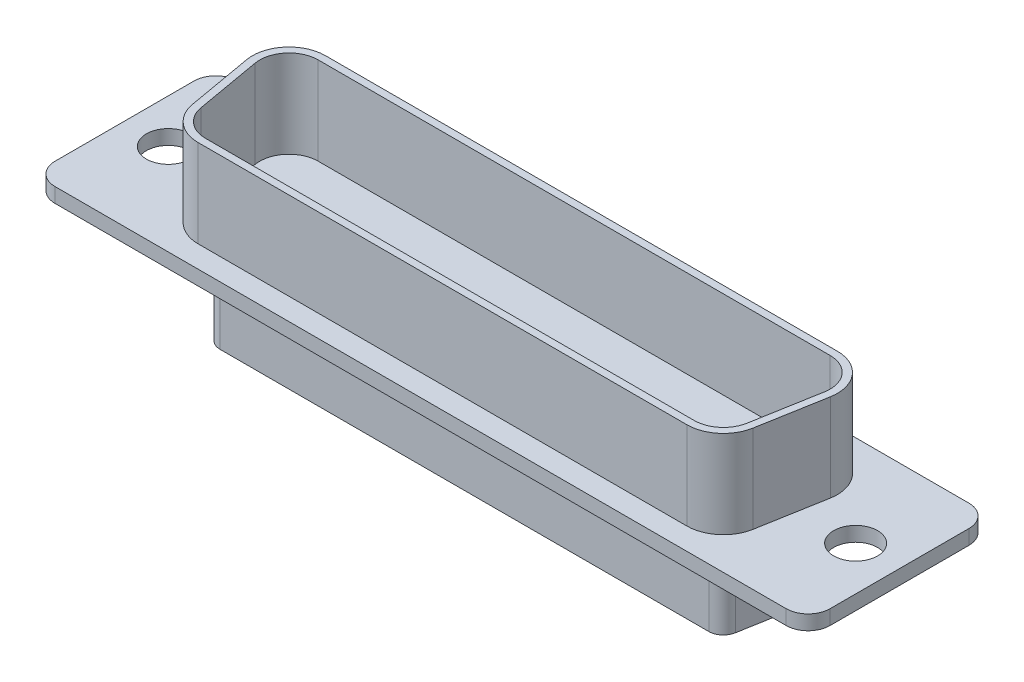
ISO-10303-21;
HEADER;
FILE_DESCRIPTION(('STEP AP214'),'2;1');
FILE_NAME('part.step','',(''),(''),'','','');
FILE_SCHEMA(('AUTOMOTIVE_DESIGN { 1 0 10303 214 1 1 1 1 }'));
ENDSEC;
DATA;
#1=APPLICATION_CONTEXT('core data for automotive mechanical design processes');
#2=APPLICATION_PROTOCOL_DEFINITION('international standard','automotive_design',2000,#1);
#3=PRODUCT_CONTEXT('',#1,'mechanical');
#4=PRODUCT('Part','Part','',(#3));
#5=PRODUCT_RELATED_PRODUCT_CATEGORY('part','',(#4));
#6=PRODUCT_DEFINITION_FORMATION('','',#4);
#7=PRODUCT_DEFINITION_CONTEXT('part definition',#1,'design');
#8=PRODUCT_DEFINITION('design','',#6,#7);
#9=PRODUCT_DEFINITION_SHAPE('','',#8);
#10=(LENGTH_UNIT() NAMED_UNIT(*) SI_UNIT(.MILLI.,.METRE.));
#11=(NAMED_UNIT(*) PLANE_ANGLE_UNIT() SI_UNIT($,.RADIAN.));
#12=(NAMED_UNIT(*) SI_UNIT($,.STERADIAN.) SOLID_ANGLE_UNIT());
#13=UNCERTAINTY_MEASURE_WITH_UNIT(LENGTH_MEASURE(1.E-05),#10,'distance_accuracy_value','');
#14=(GEOMETRIC_REPRESENTATION_CONTEXT(3) GLOBAL_UNCERTAINTY_ASSIGNED_CONTEXT((#13)) GLOBAL_UNIT_ASSIGNED_CONTEXT((#10,
#11,#12)) REPRESENTATION_CONTEXT('',''));
#15=CARTESIAN_POINT('',(0.,0.,0.));
#16=DIRECTION('',(0.,0.,1.));
#17=DIRECTION('',(1.,0.,0.));
#18=AXIS2_PLACEMENT_3D('',#15,#16,#17);
#19=CARTESIAN_POINT('',(0.,1.,0.));
#20=DIRECTION('',(0.,1.,0.));
#21=DIRECTION('',(0.,0.,1.));
#22=AXIS2_PLACEMENT_3D('',#19,#20,#21);
#23=PLANE('',#22);
#24=CARTESIAN_POINT('',(17.5,1.,-2.25));
#25=DIRECTION('',(0.,1.,0.));
#26=DIRECTION('',(0.,0.,1.));
#27=AXIS2_PLACEMENT_3D('',#24,#25,#26);
#28=CIRCLE('',#27,2.);
#29=CARTESIAN_POINT('',(19.4696155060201,1.,-1.90270364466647));
#30=VERTEX_POINT('',#29);
#31=CARTESIAN_POINT('',(17.5,1.,-4.25));
#32=VERTEX_POINT('',#31);
#33=EDGE_CURVE('E19',#30,#32,#28,.T.);
#34=ORIENTED_EDGE('',*,*,#33,.T.);
#35=DIRECTION('',(1.,0.,0.));
#36=VECTOR('',#35,1.);
#37=CARTESIAN_POINT('',(-17.5,1.,-4.25));
#38=LINE('',#37,#36);
#39=CARTESIAN_POINT('',(-17.5,1.,-4.25));
#40=VERTEX_POINT('',#39);
#41=EDGE_CURVE('E352',#40,#32,#38,.T.);
#42=ORIENTED_EDGE('',*,*,#41,.F.);
#43=CARTESIAN_POINT('',(-17.5,1.,-2.25));
#44=DIRECTION('',(0.,1.,0.));
#45=DIRECTION('',(0.,0.,1.));
#46=AXIS2_PLACEMENT_3D('',#43,#44,#45);
#47=CIRCLE('',#46,2.);
#48=CARTESIAN_POINT('',(-19.4696155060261,1.,-1.90270364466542));
#49=VERTEX_POINT('',#48);
#50=EDGE_CURVE('E353',#40,#49,#47,.T.);
#51=ORIENTED_EDGE('',*,*,#50,.T.);
#52=DIRECTION('',(-0.173648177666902,0.,-0.984807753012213));
#53=VECTOR('',#52,1.);
#54=CARTESIAN_POINT('',(-18.67614409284,1.,2.597296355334));
#55=LINE('',#54,#53);
#56=CARTESIAN_POINT('',(-18.6761440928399,1.,2.59729635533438));
#57=VERTEX_POINT('',#56);
#58=EDGE_CURVE('E357',#57,#49,#55,.T.);
#59=ORIENTED_EDGE('',*,*,#58,.F.);
#60=CARTESIAN_POINT('',(-16.70652858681,1.,2.25));
#61=DIRECTION('',(0.,1.,0.));
#62=DIRECTION('',(0.,0.,1.));
#63=AXIS2_PLACEMENT_3D('',#60,#61,#62);
#64=CIRCLE('',#63,2.);
#65=CARTESIAN_POINT('',(-16.70652858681,1.,4.25));
#66=VERTEX_POINT('',#65);
#67=EDGE_CURVE('E358',#57,#66,#64,.T.);
#68=ORIENTED_EDGE('',*,*,#67,.T.);
#69=DIRECTION('',(-1.,0.,0.));
#70=VECTOR('',#69,1.);
#71=CARTESIAN_POINT('',(16.70652858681,1.,4.25));
#72=LINE('',#71,#70);
#73=CARTESIAN_POINT('',(16.70652858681,1.,4.25));
#74=VERTEX_POINT('',#73);
#75=EDGE_CURVE('E245',#74,#66,#72,.T.);
#76=ORIENTED_EDGE('',*,*,#75,.F.);
#77=CARTESIAN_POINT('',(16.70652858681,1.,2.25));
#78=DIRECTION('',(0.,1.,0.));
#79=DIRECTION('',(0.,0.,1.));
#80=AXIS2_PLACEMENT_3D('',#77,#78,#79);
#81=CIRCLE('',#80,2.);
#82=CARTESIAN_POINT('',(18.6761440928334,1.,2.59729635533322));
#83=VERTEX_POINT('',#82);
#84=EDGE_CURVE('E241',#74,#83,#81,.T.);
#85=ORIENTED_EDGE('',*,*,#84,.T.);
#86=DIRECTION('',(-0.173648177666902,0.,0.984807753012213));
#87=VECTOR('',#86,1.);
#88=CARTESIAN_POINT('',(19.46961550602,1.,-1.902703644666));
#89=LINE('',#88,#87);
#90=EDGE_CURVE('E235',#30,#83,#89,.T.);
#91=ORIENTED_EDGE('',*,*,#90,.F.);
#92=EDGE_LOOP('',(#34,#42,#51,#59,#68,#76,#85,#91));
#93=FACE_BOUND('',#92,.T.);
#94=ADVANCED_FACE('F16',(#93),#23,.T.);
#95=CARTESIAN_POINT('',(17.5,1.,-2.25));
#96=DIRECTION('',(0.,1.,0.));
#97=DIRECTION('',(0.,0.,1.));
#98=AXIS2_PLACEMENT_3D('',#95,#96,#97);
#99=CYLINDRICAL_SURFACE('',#98,2.);
#100=CARTESIAN_POINT('',(17.5,7.,-2.25));
#101=DIRECTION('',(0.,1.,0.));
#102=DIRECTION('',(0.,0.,1.));
#103=AXIS2_PLACEMENT_3D('',#100,#101,#102);
#104=CIRCLE('',#103,2.);
#105=CARTESIAN_POINT('',(17.5,7.,-4.25));
#106=VERTEX_POINT('',#105);
#107=CARTESIAN_POINT('',(19.4696155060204,7.,-1.90270364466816));
#108=VERTEX_POINT('',#107);
#109=EDGE_CURVE('E350',#106,#108,#104,.F.);
#110=ORIENTED_EDGE('',*,*,#109,.F.);
#111=DIRECTION('',(0.,1.,0.));
#112=VECTOR('',#111,1.);
#113=CARTESIAN_POINT('',(17.5,1.,-4.25));
#114=LINE('',#113,#112);
#115=EDGE_CURVE('E227',#32,#106,#114,.T.);
#116=ORIENTED_EDGE('',*,*,#115,.F.);
#117=ORIENTED_EDGE('',*,*,#33,.F.);
#118=DIRECTION('',(0.,1.,0.));
#119=VECTOR('',#118,1.);
#120=CARTESIAN_POINT('',(19.46961550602,1.,-1.902703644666));
#121=LINE('',#120,#119);
#122=EDGE_CURVE('E225',#108,#30,#121,.F.);
#123=ORIENTED_EDGE('',*,*,#122,.F.);
#124=EDGE_LOOP('',(#110,#116,#117,#123));
#125=FACE_BOUND('',#124,.T.);
#126=ADVANCED_FACE('F224',(#125),#99,.F.);
#127=CARTESIAN_POINT('',(19.46961550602,1.,-1.902703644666));
#128=DIRECTION('',(-0.984807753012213,0.,-0.173648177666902));
#129=DIRECTION('',(-0.173648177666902,0.,0.984807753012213));
#130=AXIS2_PLACEMENT_3D('',#127,#128,#129);
#131=PLANE('',#130);
#132=ORIENTED_EDGE('',*,*,#122,.T.);
#133=ORIENTED_EDGE('',*,*,#90,.T.);
#134=DIRECTION('',(0.,1.,0.));
#135=VECTOR('',#134,1.);
#136=CARTESIAN_POINT('',(18.6761440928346,1.,2.59729635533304));
#137=LINE('',#136,#135);
#138=CARTESIAN_POINT('',(18.6761440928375,7.,2.59729635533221));
#139=VERTEX_POINT('',#138);
#140=EDGE_CURVE('E243',#83,#139,#137,.T.);
#141=ORIENTED_EDGE('',*,*,#140,.T.);
#142=DIRECTION('',(-0.173648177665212,0.,0.984807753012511));
#143=VECTOR('',#142,1.);
#144=CARTESIAN_POINT('',(19.46961550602,7.,-1.902703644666));
#145=LINE('',#144,#143);
#146=EDGE_CURVE('E237',#108,#139,#145,.T.);
#147=ORIENTED_EDGE('',*,*,#146,.F.);
#148=EDGE_LOOP('',(#132,#133,#141,#147));
#149=FACE_BOUND('',#148,.T.);
#150=ADVANCED_FACE('F233',(#149),#131,.T.);
#151=CARTESIAN_POINT('',(16.70652858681,1.,2.25));
#152=DIRECTION('',(0.,1.,0.));
#153=DIRECTION('',(0.,0.,1.));
#154=AXIS2_PLACEMENT_3D('',#151,#152,#153);
#155=CYLINDRICAL_SURFACE('',#154,2.);
#156=CARTESIAN_POINT('',(16.70652858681,7.,2.25));
#157=DIRECTION('',(0.,1.,0.));
#158=DIRECTION('',(0.,0.,1.));
#159=AXIS2_PLACEMENT_3D('',#156,#157,#158);
#160=CIRCLE('',#159,2.);
#161=CARTESIAN_POINT('',(16.70652858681,7.,4.25));
#162=VERTEX_POINT('',#161);
#163=EDGE_CURVE('E348',#139,#162,#160,.F.);
#164=ORIENTED_EDGE('',*,*,#163,.F.);
#165=ORIENTED_EDGE('',*,*,#140,.F.);
#166=ORIENTED_EDGE('',*,*,#84,.F.);
#167=DIRECTION('',(0.,1.,0.));
#168=VECTOR('',#167,1.);
#169=CARTESIAN_POINT('',(16.70652858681,1.,4.25));
#170=LINE('',#169,#168);
#171=EDGE_CURVE('E365',#162,#74,#170,.F.);
#172=ORIENTED_EDGE('',*,*,#171,.F.);
#173=EDGE_LOOP('',(#164,#165,#166,#172));
#174=FACE_BOUND('',#173,.T.);
#175=ADVANCED_FACE('F823',(#174),#155,.F.);
#176=CARTESIAN_POINT('',(16.70652858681,1.,4.25));
#177=DIRECTION('',(0.,0.,-1.));
#178=DIRECTION('',(-1.,0.,0.));
#179=AXIS2_PLACEMENT_3D('',#176,#177,#178);
#180=PLANE('',#179);
#181=ORIENTED_EDGE('',*,*,#171,.T.);
#182=ORIENTED_EDGE('',*,*,#75,.T.);
#183=DIRECTION('',(0.,1.,0.));
#184=VECTOR('',#183,1.);
#185=CARTESIAN_POINT('',(-16.70652858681,1.,4.25));
#186=LINE('',#185,#184);
#187=CARTESIAN_POINT('',(-16.70652858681,7.,4.25));
#188=VERTEX_POINT('',#187);
#189=EDGE_CURVE('E360',#66,#188,#186,.T.);
#190=ORIENTED_EDGE('',*,*,#189,.T.);
#191=DIRECTION('',(1.,0.,0.));
#192=VECTOR('',#191,1.);
#193=CARTESIAN_POINT('',(0.,7.,4.25));
#194=LINE('',#193,#192);
#195=EDGE_CURVE('E347',#162,#188,#194,.F.);
#196=ORIENTED_EDGE('',*,*,#195,.F.);
#197=EDGE_LOOP('',(#181,#182,#190,#196));
#198=FACE_BOUND('',#197,.T.);
#199=ADVANCED_FACE('F814',(#198),#180,.T.);
#200=CARTESIAN_POINT('',(-16.70652858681,1.,2.25));
#201=DIRECTION('',(0.,1.,0.));
#202=DIRECTION('',(0.,0.,1.));
#203=AXIS2_PLACEMENT_3D('',#200,#201,#202);
#204=CYLINDRICAL_SURFACE('',#203,2.);
#205=CARTESIAN_POINT('',(-16.70652858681,7.,2.25));
#206=DIRECTION('',(0.,1.,0.));
#207=DIRECTION('',(0.,0.,1.));
#208=AXIS2_PLACEMENT_3D('',#205,#206,#207);
#209=CIRCLE('',#208,2.);
#210=CARTESIAN_POINT('',(-18.6761440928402,7.,2.59729635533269));
#211=VERTEX_POINT('',#210);
#212=EDGE_CURVE('E345',#188,#211,#209,.F.);
#213=ORIENTED_EDGE('',*,*,#212,.F.);
#214=ORIENTED_EDGE('',*,*,#189,.F.);
#215=ORIENTED_EDGE('',*,*,#67,.F.);
#216=DIRECTION('',(0.,1.,0.));
#217=VECTOR('',#216,1.);
#218=CARTESIAN_POINT('',(-18.67614409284,1.,2.597296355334));
#219=LINE('',#218,#217);
#220=EDGE_CURVE('E363',#211,#57,#219,.F.);
#221=ORIENTED_EDGE('',*,*,#220,.F.);
#222=EDGE_LOOP('',(#213,#214,#215,#221));
#223=FACE_BOUND('',#222,.T.);
#224=ADVANCED_FACE('F806',(#223),#204,.F.);
#225=CARTESIAN_POINT('',(-18.67614409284,1.,2.597296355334));
#226=DIRECTION('',(0.984807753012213,0.,-0.173648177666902));
#227=DIRECTION('',(-0.173648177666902,0.,-0.984807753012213));
#228=AXIS2_PLACEMENT_3D('',#225,#226,#227);
#229=PLANE('',#228);
#230=ORIENTED_EDGE('',*,*,#220,.T.);
#231=ORIENTED_EDGE('',*,*,#58,.T.);
#232=DIRECTION('',(0.,1.,0.));
#233=VECTOR('',#232,1.);
#234=CARTESIAN_POINT('',(-19.4696155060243,1.,-1.90270364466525));
#235=LINE('',#234,#233);
#236=CARTESIAN_POINT('',(-19.4696155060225,7.,-1.90270364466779));
#237=VERTEX_POINT('',#236);
#238=EDGE_CURVE('E356',#49,#237,#235,.T.);
#239=ORIENTED_EDGE('',*,*,#238,.T.);
#240=DIRECTION('',(-0.173648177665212,0.,-0.984807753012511));
#241=VECTOR('',#240,1.);
#242=CARTESIAN_POINT('',(-18.67614409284,7.,2.597296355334));
#243=LINE('',#242,#241);
#244=EDGE_CURVE('E344',#211,#237,#243,.T.);
#245=ORIENTED_EDGE('',*,*,#244,.F.);
#246=EDGE_LOOP('',(#230,#231,#239,#245));
#247=FACE_BOUND('',#246,.T.);
#248=ADVANCED_FACE('F797',(#247),#229,.T.);
#249=CARTESIAN_POINT('',(-17.5,1.,-2.25));
#250=DIRECTION('',(0.,1.,0.));
#251=DIRECTION('',(0.,0.,1.));
#252=AXIS2_PLACEMENT_3D('',#249,#250,#251);
#253=CYLINDRICAL_SURFACE('',#252,2.);
#254=CARTESIAN_POINT('',(-17.5,7.,-2.25));
#255=DIRECTION('',(0.,1.,0.));
#256=DIRECTION('',(0.,0.,1.));
#257=AXIS2_PLACEMENT_3D('',#254,#255,#256);
#258=CIRCLE('',#257,2.);
#259=CARTESIAN_POINT('',(-17.5,7.,-4.25));
#260=VERTEX_POINT('',#259);
#261=EDGE_CURVE('E341',#237,#260,#258,.F.);
#262=ORIENTED_EDGE('',*,*,#261,.F.);
#263=ORIENTED_EDGE('',*,*,#238,.F.);
#264=ORIENTED_EDGE('',*,*,#50,.F.);
#265=DIRECTION('',(0.,1.,0.));
#266=VECTOR('',#265,1.);
#267=CARTESIAN_POINT('',(-17.5,1.,-4.25));
#268=LINE('',#267,#266);
#269=EDGE_CURVE('E375',#260,#40,#268,.F.);
#270=ORIENTED_EDGE('',*,*,#269,.F.);
#271=EDGE_LOOP('',(#262,#263,#264,#270));
#272=FACE_BOUND('',#271,.T.);
#273=ADVANCED_FACE('F788',(#272),#253,.F.);
#274=CARTESIAN_POINT('',(-17.5,1.,-4.25));
#275=DIRECTION('',(0.,0.,1.));
#276=DIRECTION('',(1.,0.,0.));
#277=AXIS2_PLACEMENT_3D('',#274,#275,#276);
#278=PLANE('',#277);
#279=ORIENTED_EDGE('',*,*,#269,.T.);
#280=ORIENTED_EDGE('',*,*,#41,.T.);
#281=ORIENTED_EDGE('',*,*,#115,.T.);
#282=DIRECTION('',(1.,0.,0.));
#283=VECTOR('',#282,1.);
#284=CARTESIAN_POINT('',(0.,7.,-4.25));
#285=LINE('',#284,#283);
#286=EDGE_CURVE('E343',#260,#106,#285,.T.);
#287=ORIENTED_EDGE('',*,*,#286,.F.);
#288=EDGE_LOOP('',(#279,#280,#281,#287));
#289=FACE_BOUND('',#288,.T.);
#290=ADVANCED_FACE('F779',(#289),#278,.T.);
#291=CARTESIAN_POINT('',(0.,7.,0.));
#292=DIRECTION('',(0.,1.,0.));
#293=DIRECTION('',(0.,0.,1.));
#294=AXIS2_PLACEMENT_3D('',#291,#292,#293);
#295=PLANE('',#294);
#296=ORIENTED_EDGE('',*,*,#261,.T.);
#297=ORIENTED_EDGE('',*,*,#286,.T.);
#298=ORIENTED_EDGE('',*,*,#109,.T.);
#299=ORIENTED_EDGE('',*,*,#146,.T.);
#300=ORIENTED_EDGE('',*,*,#163,.T.);
#301=ORIENTED_EDGE('',*,*,#195,.T.);
#302=ORIENTED_EDGE('',*,*,#212,.T.);
#303=ORIENTED_EDGE('',*,*,#244,.T.);
#304=EDGE_LOOP('',(#296,#297,#298,#299,#300,#301,#302,#303));
#305=FACE_BOUND('',#304,.T.);
#306=DIRECTION('',(-1.,0.,0.));
#307=VECTOR('',#306,1.);
#308=CARTESIAN_POINT('',(17.5,7.,-4.75));
#309=LINE('',#308,#307);
#310=CARTESIAN_POINT('',(-17.5,7.,-4.75));
#311=VERTEX_POINT('',#310);
#312=CARTESIAN_POINT('',(17.5,7.,-4.75));
#313=VERTEX_POINT('',#312);
#314=EDGE_CURVE('E398',#311,#313,#309,.F.);
#315=ORIENTED_EDGE('',*,*,#314,.F.);
#316=CARTESIAN_POINT('',(-17.5,7.,-2.25));
#317=DIRECTION('',(0.,1.,0.));
#318=DIRECTION('',(0.,0.,1.));
#319=AXIS2_PLACEMENT_3D('',#316,#317,#318);
#320=CIRCLE('',#319,2.5);
#321=CARTESIAN_POINT('',(-19.9620193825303,7.,-1.81587955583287));
#322=VERTEX_POINT('',#321);
#323=EDGE_CURVE('E325',#322,#311,#320,.F.);
#324=ORIENTED_EDGE('',*,*,#323,.F.);
#325=DIRECTION('',(0.173648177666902,0.,0.984807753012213));
#326=VECTOR('',#325,1.);
#327=CARTESIAN_POINT('',(-19.96201938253,7.,-1.815879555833));
#328=LINE('',#327,#326);
#329=CARTESIAN_POINT('',(-19.168547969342,7.,2.68412044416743));
#330=VERTEX_POINT('',#329);
#331=EDGE_CURVE('E391',#330,#322,#328,.F.);
#332=ORIENTED_EDGE('',*,*,#331,.F.);
#333=CARTESIAN_POINT('',(-16.70652858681,7.,2.25));
#334=DIRECTION('',(0.,1.,0.));
#335=DIRECTION('',(0.,0.,1.));
#336=AXIS2_PLACEMENT_3D('',#333,#334,#335);
#337=CIRCLE('',#336,2.5);
#338=CARTESIAN_POINT('',(-16.70652858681,7.,4.75));
#339=VERTEX_POINT('',#338);
#340=EDGE_CURVE('E329',#339,#330,#337,.F.);
#341=ORIENTED_EDGE('',*,*,#340,.F.);
#342=DIRECTION('',(1.,0.,0.));
#343=VECTOR('',#342,1.);
#344=CARTESIAN_POINT('',(-16.70652858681,7.,4.75));
#345=LINE('',#344,#343);
#346=CARTESIAN_POINT('',(16.70652858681,7.,4.75));
#347=VERTEX_POINT('',#346);
#348=EDGE_CURVE('E389',#347,#339,#345,.F.);
#349=ORIENTED_EDGE('',*,*,#348,.F.);
#350=CARTESIAN_POINT('',(16.70652858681,7.,2.25));
#351=DIRECTION('',(0.,1.,0.));
#352=DIRECTION('',(0.,0.,1.));
#353=AXIS2_PLACEMENT_3D('',#350,#351,#352);
#354=CIRCLE('',#353,2.5);
#355=CARTESIAN_POINT('',(19.1685479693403,7.,2.68412044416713));
#356=VERTEX_POINT('',#355);
#357=EDGE_CURVE('E333',#356,#347,#354,.F.);
#358=ORIENTED_EDGE('',*,*,#357,.F.);
#359=DIRECTION('',(0.173648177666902,0.,-0.984807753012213));
#360=VECTOR('',#359,1.);
#361=CARTESIAN_POINT('',(19.16854796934,7.,2.684120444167));
#362=LINE('',#361,#360);
#363=CARTESIAN_POINT('',(19.962019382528,7.,-1.81587955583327));
#364=VERTEX_POINT('',#363);
#365=EDGE_CURVE('E387',#364,#356,#362,.F.);
#366=ORIENTED_EDGE('',*,*,#365,.F.);
#367=CARTESIAN_POINT('',(17.5,7.,-2.25));
#368=DIRECTION('',(0.,1.,0.));
#369=DIRECTION('',(0.,0.,1.));
#370=AXIS2_PLACEMENT_3D('',#367,#368,#369);
#371=CIRCLE('',#370,2.5);
#372=EDGE_CURVE('E337',#313,#364,#371,.F.);
#373=ORIENTED_EDGE('',*,*,#372,.F.);
#374=EDGE_LOOP('',(#315,#324,#332,#341,#349,#358,#366,#373));
#375=FACE_BOUND('',#374,.T.);
#376=ADVANCED_FACE('F770',(#305,#375),#295,.T.);
#377=CARTESIAN_POINT('',(17.5,1.,-4.75));
#378=DIRECTION('',(0.,0.,-1.));
#379=DIRECTION('',(-1.,0.,0.));
#380=AXIS2_PLACEMENT_3D('',#377,#378,#379);
#381=PLANE('',#380);
#382=DIRECTION('',(0.,1.,0.));
#383=VECTOR('',#382,1.);
#384=CARTESIAN_POINT('',(17.5,1.,-4.75));
#385=LINE('',#384,#383);
#386=CARTESIAN_POINT('',(17.5,1.,-4.75));
#387=VERTEX_POINT('',#386);
#388=EDGE_CURVE('E340',#387,#313,#385,.T.);
#389=ORIENTED_EDGE('',*,*,#388,.F.);
#390=DIRECTION('',(1.,0.,0.));
#391=VECTOR('',#390,1.);
#392=CARTESIAN_POINT('',(0.,1.,-4.75));
#393=LINE('',#392,#391);
#394=CARTESIAN_POINT('',(-17.5,1.,-4.75));
#395=VERTEX_POINT('',#394);
#396=EDGE_CURVE('E324',#395,#387,#393,.T.);
#397=ORIENTED_EDGE('',*,*,#396,.F.);
#398=DIRECTION('',(0.,1.,0.));
#399=VECTOR('',#398,1.);
#400=CARTESIAN_POINT('',(-17.5,1.,-4.75));
#401=LINE('',#400,#399);
#402=EDGE_CURVE('E327',#311,#395,#401,.F.);
#403=ORIENTED_EDGE('',*,*,#402,.F.);
#404=ORIENTED_EDGE('',*,*,#314,.T.);
#405=EDGE_LOOP('',(#389,#397,#403,#404));
#406=FACE_BOUND('',#405,.T.);
#407=ADVANCED_FACE('F761',(#406),#381,.T.);
#408=CARTESIAN_POINT('',(17.5,1.,-2.25));
#409=DIRECTION('',(0.,1.,0.));
#410=DIRECTION('',(0.,0.,1.));
#411=AXIS2_PLACEMENT_3D('',#408,#409,#410);
#412=CYLINDRICAL_SURFACE('',#411,2.5);
#413=DIRECTION('',(0.,1.,0.));
#414=VECTOR('',#413,1.);
#415=CARTESIAN_POINT('',(19.962019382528,1.,-1.81587955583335));
#416=LINE('',#415,#414);
#417=CARTESIAN_POINT('',(19.9620193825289,1.,-1.81587955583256));
#418=VERTEX_POINT('',#417);
#419=EDGE_CURVE('E339',#418,#364,#416,.T.);
#420=ORIENTED_EDGE('',*,*,#419,.F.);
#421=CARTESIAN_POINT('',(17.5,1.,-2.25));
#422=DIRECTION('',(0.,1.,0.));
#423=DIRECTION('',(0.,0.,1.));
#424=AXIS2_PLACEMENT_3D('',#421,#422,#423);
#425=CIRCLE('',#424,2.5);
#426=EDGE_CURVE('E322',#387,#418,#425,.F.);
#427=ORIENTED_EDGE('',*,*,#426,.F.);
#428=ORIENTED_EDGE('',*,*,#388,.T.);
#429=ORIENTED_EDGE('',*,*,#372,.T.);
#430=EDGE_LOOP('',(#420,#427,#428,#429));
#431=FACE_BOUND('',#430,.T.);
#432=ADVANCED_FACE('F752',(#431),#412,.T.);
#433=CARTESIAN_POINT('',(19.16854796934,1.,2.684120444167));
#434=DIRECTION('',(0.984807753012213,0.,0.173648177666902));
#435=DIRECTION('',(0.173648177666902,0.,-0.984807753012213));
#436=AXIS2_PLACEMENT_3D('',#433,#434,#435);
#437=PLANE('',#436);
#438=DIRECTION('',(0.,1.,0.));
#439=VECTOR('',#438,1.);
#440=CARTESIAN_POINT('',(19.1685479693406,1.,2.6841204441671));
#441=LINE('',#440,#439);
#442=CARTESIAN_POINT('',(19.1685479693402,1.,2.68412044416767));
#443=VERTEX_POINT('',#442);
#444=EDGE_CURVE('E336',#443,#356,#441,.T.);
#445=ORIENTED_EDGE('',*,*,#444,.F.);
#446=DIRECTION('',(-0.173648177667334,0.,0.984807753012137));
#447=VECTOR('',#446,1.);
#448=CARTESIAN_POINT('',(19.96201938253,1.,-1.815879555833));
#449=LINE('',#448,#447);
#450=EDGE_CURVE('E321',#418,#443,#449,.T.);
#451=ORIENTED_EDGE('',*,*,#450,.F.);
#452=ORIENTED_EDGE('',*,*,#419,.T.);
#453=ORIENTED_EDGE('',*,*,#365,.T.);
#454=EDGE_LOOP('',(#445,#451,#452,#453));
#455=FACE_BOUND('',#454,.T.);
#456=ADVANCED_FACE('F743',(#455),#437,.T.);
#457=CARTESIAN_POINT('',(16.70652858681,1.,2.25));
#458=DIRECTION('',(0.,1.,0.));
#459=DIRECTION('',(0.,0.,1.));
#460=AXIS2_PLACEMENT_3D('',#457,#458,#459);
#461=CYLINDRICAL_SURFACE('',#460,2.5);
#462=DIRECTION('',(0.,1.,0.));
#463=VECTOR('',#462,1.);
#464=CARTESIAN_POINT('',(16.70652858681,1.,4.75));
#465=LINE('',#464,#463);
#466=CARTESIAN_POINT('',(16.70652858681,1.,4.75));
#467=VERTEX_POINT('',#466);
#468=EDGE_CURVE('E335',#467,#347,#465,.T.);
#469=ORIENTED_EDGE('',*,*,#468,.F.);
#470=CARTESIAN_POINT('',(16.70652858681,1.,2.25));
#471=DIRECTION('',(0.,1.,0.));
#472=DIRECTION('',(0.,0.,1.));
#473=AXIS2_PLACEMENT_3D('',#470,#471,#472);
#474=CIRCLE('',#473,2.5);
#475=EDGE_CURVE('E319',#443,#467,#474,.F.);
#476=ORIENTED_EDGE('',*,*,#475,.F.);
#477=ORIENTED_EDGE('',*,*,#444,.T.);
#478=ORIENTED_EDGE('',*,*,#357,.T.);
#479=EDGE_LOOP('',(#469,#476,#477,#478));
#480=FACE_BOUND('',#479,.T.);
#481=ADVANCED_FACE('F734',(#480),#461,.T.);
#482=CARTESIAN_POINT('',(-16.70652858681,1.,4.75));
#483=DIRECTION('',(0.,0.,1.));
#484=DIRECTION('',(1.,0.,0.));
#485=AXIS2_PLACEMENT_3D('',#482,#483,#484);
#486=PLANE('',#485);
#487=DIRECTION('',(0.,1.,0.));
#488=VECTOR('',#487,1.);
#489=CARTESIAN_POINT('',(-16.70652858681,1.,4.75));
#490=LINE('',#489,#488);
#491=CARTESIAN_POINT('',(-16.70652858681,1.,4.75));
#492=VERTEX_POINT('',#491);
#493=EDGE_CURVE('E332',#492,#339,#490,.T.);
#494=ORIENTED_EDGE('',*,*,#493,.F.);
#495=DIRECTION('',(1.,0.,0.));
#496=VECTOR('',#495,1.);
#497=CARTESIAN_POINT('',(0.,1.,4.75));
#498=LINE('',#497,#496);
#499=EDGE_CURVE('E318',#467,#492,#498,.F.);
#500=ORIENTED_EDGE('',*,*,#499,.F.);
#501=ORIENTED_EDGE('',*,*,#468,.T.);
#502=ORIENTED_EDGE('',*,*,#348,.T.);
#503=EDGE_LOOP('',(#494,#500,#501,#502));
#504=FACE_BOUND('',#503,.T.);
#505=ADVANCED_FACE('F725',(#504),#486,.T.);
#506=CARTESIAN_POINT('',(-16.70652858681,1.,2.25));
#507=DIRECTION('',(0.,1.,0.));
#508=DIRECTION('',(0.,0.,1.));
#509=AXIS2_PLACEMENT_3D('',#506,#507,#508);
#510=CYLINDRICAL_SURFACE('',#509,2.5);
#511=DIRECTION('',(0.,1.,0.));
#512=VECTOR('',#511,1.);
#513=CARTESIAN_POINT('',(-19.168547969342,1.,2.68412044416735));
#514=LINE('',#513,#512);
#515=CARTESIAN_POINT('',(-19.1685479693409,1.,2.68412044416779));
#516=VERTEX_POINT('',#515);
#517=EDGE_CURVE('E331',#516,#330,#514,.T.);
#518=ORIENTED_EDGE('',*,*,#517,.F.);
#519=CARTESIAN_POINT('',(-16.70652858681,1.,2.25));
#520=DIRECTION('',(0.,1.,0.));
#521=DIRECTION('',(0.,0.,1.));
#522=AXIS2_PLACEMENT_3D('',#519,#520,#521);
#523=CIRCLE('',#522,2.5);
#524=EDGE_CURVE('E316',#492,#516,#523,.F.);
#525=ORIENTED_EDGE('',*,*,#524,.F.);
#526=ORIENTED_EDGE('',*,*,#493,.T.);
#527=ORIENTED_EDGE('',*,*,#340,.T.);
#528=EDGE_LOOP('',(#518,#525,#526,#527));
#529=FACE_BOUND('',#528,.T.);
#530=ADVANCED_FACE('F716',(#529),#510,.T.);
#531=CARTESIAN_POINT('',(-19.96201938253,1.,-1.815879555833));
#532=DIRECTION('',(-0.984807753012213,0.,0.173648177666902));
#533=DIRECTION('',(0.173648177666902,0.,0.984807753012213));
#534=AXIS2_PLACEMENT_3D('',#531,#532,#533);
#535=PLANE('',#534);
#536=DIRECTION('',(0.,1.,0.));
#537=VECTOR('',#536,1.);
#538=CARTESIAN_POINT('',(-19.9620193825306,1.,-1.8158795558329));
#539=LINE('',#538,#537);
#540=CARTESIAN_POINT('',(-19.9620193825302,1.,-1.81587955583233));
#541=VERTEX_POINT('',#540);
#542=EDGE_CURVE('E328',#541,#322,#539,.T.);
#543=ORIENTED_EDGE('',*,*,#542,.F.);
#544=DIRECTION('',(-0.173648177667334,0.,-0.984807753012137));
#545=VECTOR('',#544,1.);
#546=CARTESIAN_POINT('',(-19.16854796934,1.,2.684120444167));
#547=LINE('',#546,#545);
#548=EDGE_CURVE('E315',#516,#541,#547,.T.);
#549=ORIENTED_EDGE('',*,*,#548,.F.);
#550=ORIENTED_EDGE('',*,*,#517,.T.);
#551=ORIENTED_EDGE('',*,*,#331,.T.);
#552=EDGE_LOOP('',(#543,#549,#550,#551));
#553=FACE_BOUND('',#552,.T.);
#554=ADVANCED_FACE('F707',(#553),#535,.T.);
#555=CARTESIAN_POINT('',(-17.5,1.,-2.25));
#556=DIRECTION('',(0.,1.,0.));
#557=DIRECTION('',(0.,0.,1.));
#558=AXIS2_PLACEMENT_3D('',#555,#556,#557);
#559=CYLINDRICAL_SURFACE('',#558,2.5);
#560=ORIENTED_EDGE('',*,*,#402,.T.);
#561=CARTESIAN_POINT('',(-17.5,1.,-2.25));
#562=DIRECTION('',(0.,1.,0.));
#563=DIRECTION('',(0.,0.,1.));
#564=AXIS2_PLACEMENT_3D('',#561,#562,#563);
#565=CIRCLE('',#564,2.5);
#566=EDGE_CURVE('E312',#541,#395,#565,.F.);
#567=ORIENTED_EDGE('',*,*,#566,.F.);
#568=ORIENTED_EDGE('',*,*,#542,.T.);
#569=ORIENTED_EDGE('',*,*,#323,.T.);
#570=EDGE_LOOP('',(#560,#567,#568,#569));
#571=FACE_BOUND('',#570,.T.);
#572=ADVANCED_FACE('F698',(#571),#559,.T.);
#573=CARTESIAN_POINT('',(0.,1.,0.));
#574=DIRECTION('',(0.,1.,0.));
#575=DIRECTION('',(0.,0.,1.));
#576=AXIS2_PLACEMENT_3D('',#573,#574,#575);
#577=PLANE('',#576);
#578=ORIENTED_EDGE('',*,*,#548,.T.);
#579=ORIENTED_EDGE('',*,*,#566,.T.);
#580=ORIENTED_EDGE('',*,*,#396,.T.);
#581=ORIENTED_EDGE('',*,*,#426,.T.);
#582=ORIENTED_EDGE('',*,*,#450,.T.);
#583=ORIENTED_EDGE('',*,*,#475,.T.);
#584=ORIENTED_EDGE('',*,*,#499,.T.);
#585=ORIENTED_EDGE('',*,*,#524,.T.);
#586=EDGE_LOOP('',(#578,#579,#580,#581,#582,#583,#584,#585));
#587=FACE_BOUND('',#586,.T.);
#588=CARTESIAN_POINT('',(-23.5,1.,0.));
#589=DIRECTION('',(0.,1.,0.));
#590=DIRECTION('',(0.,0.,1.));
#591=AXIS2_PLACEMENT_3D('',#588,#589,#590);
#592=CIRCLE('',#591,1.5);
#593=CARTESIAN_POINT('',(-23.5,1.,1.5));
#594=VERTEX_POINT('',#593);
#595=EDGE_CURVE('E282',#594,#594,#592,.F.);
#596=ORIENTED_EDGE('',*,*,#595,.T.);
#597=EDGE_LOOP('',(#596));
#598=FACE_BOUND('',#597,.T.);
#599=CARTESIAN_POINT('',(23.5,1.,0.));
#600=DIRECTION('',(0.,1.,0.));
#601=DIRECTION('',(0.,0.,1.));
#602=AXIS2_PLACEMENT_3D('',#599,#600,#601);
#603=CIRCLE('',#602,1.5);
#604=CARTESIAN_POINT('',(23.5,1.,1.5));
#605=VERTEX_POINT('',#604);
#606=EDGE_CURVE('E285',#605,#605,#603,.F.);
#607=ORIENTED_EDGE('',*,*,#606,.T.);
#608=EDGE_LOOP('',(#607));
#609=FACE_BOUND('',#608,.T.);
#610=DIRECTION('',(-1.,0.,0.));
#611=VECTOR('',#610,1.);
#612=CARTESIAN_POINT('',(25.,1.,-6.25));
#613=LINE('',#612,#611);
#614=CARTESIAN_POINT('',(-25.,1.,-6.25));
#615=VERTEX_POINT('',#614);
#616=CARTESIAN_POINT('',(25.,1.,-6.25));
#617=VERTEX_POINT('',#616);
#618=EDGE_CURVE('E420',#615,#617,#613,.F.);
#619=ORIENTED_EDGE('',*,*,#618,.F.);
#620=CARTESIAN_POINT('',(-25.,1.,-4.75));
#621=DIRECTION('',(0.,1.,0.));
#622=DIRECTION('',(0.,0.,1.));
#623=AXIS2_PLACEMENT_3D('',#620,#621,#622);
#624=CIRCLE('',#623,1.5);
#625=CARTESIAN_POINT('',(-26.5,1.,-4.75));
#626=VERTEX_POINT('',#625);
#627=EDGE_CURVE('E301',#626,#615,#624,.F.);
#628=ORIENTED_EDGE('',*,*,#627,.F.);
#629=DIRECTION('',(0.,0.,1.));
#630=VECTOR('',#629,1.);
#631=CARTESIAN_POINT('',(-26.5,1.,-4.75));
#632=LINE('',#631,#630);
#633=CARTESIAN_POINT('',(-26.5,1.,4.75));
#634=VERTEX_POINT('',#633);
#635=EDGE_CURVE('E303',#634,#626,#632,.F.);
#636=ORIENTED_EDGE('',*,*,#635,.F.);
#637=CARTESIAN_POINT('',(-25.,1.,4.75));
#638=DIRECTION('',(0.,1.,0.));
#639=DIRECTION('',(0.,0.,1.));
#640=AXIS2_PLACEMENT_3D('',#637,#638,#639);
#641=CIRCLE('',#640,1.5);
#642=CARTESIAN_POINT('',(-25.,1.,6.25));
#643=VERTEX_POINT('',#642);
#644=EDGE_CURVE('E297',#643,#634,#641,.F.);
#645=ORIENTED_EDGE('',*,*,#644,.F.);
#646=DIRECTION('',(1.,0.,0.));
#647=VECTOR('',#646,1.);
#648=CARTESIAN_POINT('',(-25.,1.,6.25));
#649=LINE('',#648,#647);
#650=CARTESIAN_POINT('',(25.,1.,6.25));
#651=VERTEX_POINT('',#650);
#652=EDGE_CURVE('E416',#651,#643,#649,.F.);
#653=ORIENTED_EDGE('',*,*,#652,.F.);
#654=CARTESIAN_POINT('',(25.,1.,4.75));
#655=DIRECTION('',(0.,1.,0.));
#656=DIRECTION('',(0.,0.,1.));
#657=AXIS2_PLACEMENT_3D('',#654,#655,#656);
#658=CIRCLE('',#657,1.5);
#659=CARTESIAN_POINT('',(26.5,1.,4.75));
#660=VERTEX_POINT('',#659);
#661=EDGE_CURVE('E293',#660,#651,#658,.F.);
#662=ORIENTED_EDGE('',*,*,#661,.F.);
#663=DIRECTION('',(0.,0.,-1.));
#664=VECTOR('',#663,1.);
#665=CARTESIAN_POINT('',(26.5,1.,4.75));
#666=LINE('',#665,#664);
#667=CARTESIAN_POINT('',(26.5,1.,-4.75));
#668=VERTEX_POINT('',#667);
#669=EDGE_CURVE('E418',#668,#660,#666,.F.);
#670=ORIENTED_EDGE('',*,*,#669,.F.);
#671=CARTESIAN_POINT('',(25.,1.,-4.75));
#672=DIRECTION('',(0.,1.,0.));
#673=DIRECTION('',(0.,0.,1.));
#674=AXIS2_PLACEMENT_3D('',#671,#672,#673);
#675=CIRCLE('',#674,1.5);
#676=EDGE_CURVE('E289',#617,#668,#675,.F.);
#677=ORIENTED_EDGE('',*,*,#676,.F.);
#678=EDGE_LOOP('',(#619,#628,#636,#645,#653,#662,#670,#677));
#679=FACE_BOUND('',#678,.T.);
#680=ADVANCED_FACE('F690',(#587,#598,#609,#679),#577,.T.);
#681=CARTESIAN_POINT('',(16.70652858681,0.,2.25));
#682=DIRECTION('',(0.,-1.,0.));
#683=DIRECTION('',(0.,0.,-1.));
#684=AXIS2_PLACEMENT_3D('',#681,#682,#683);
#685=CYLINDRICAL_SURFACE('',#684,1.);
#686=DIRECTION('',(0.,1.,0.));
#687=VECTOR('',#686,1.);
#688=CARTESIAN_POINT('',(17.691336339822,0.,2.42364817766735));
#689=LINE('',#688,#687);
#690=CARTESIAN_POINT('',(17.691336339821,0.,2.42364817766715));
#691=VERTEX_POINT('',#690);
#692=CARTESIAN_POINT('',(17.691336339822,-6.,2.42364817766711));
#693=VERTEX_POINT('',#692);
#694=EDGE_CURVE('E430',#691,#693,#689,.F.);
#695=ORIENTED_EDGE('',*,*,#694,.F.);
#696=CARTESIAN_POINT('',(16.70652858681,0.,2.25));
#697=DIRECTION('',(0.,-1.,0.));
#698=DIRECTION('',(0.,0.,-1.));
#699=AXIS2_PLACEMENT_3D('',#696,#697,#698);
#700=CIRCLE('',#699,1.);
#701=CARTESIAN_POINT('',(16.70652858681,0.,3.25));
#702=VERTEX_POINT('',#701);
#703=EDGE_CURVE('E310',#691,#702,#700,.T.);
#704=ORIENTED_EDGE('',*,*,#703,.T.);
#705=DIRECTION('',(0.,1.,0.));
#706=VECTOR('',#705,1.);
#707=CARTESIAN_POINT('',(16.70652858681,0.,3.25));
#708=LINE('',#707,#706);
#709=CARTESIAN_POINT('',(16.70652858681,-6.,3.25));
#710=VERTEX_POINT('',#709);
#711=EDGE_CURVE('E434',#710,#702,#708,.T.);
#712=ORIENTED_EDGE('',*,*,#711,.F.);
#713=CARTESIAN_POINT('',(16.70652858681,-6.,2.25));
#714=DIRECTION('',(0.,-1.,0.));
#715=DIRECTION('',(0.,0.,-1.));
#716=AXIS2_PLACEMENT_3D('',#713,#714,#715);
#717=CIRCLE('',#716,1.);
#718=EDGE_CURVE('E306',#693,#710,#717,.T.);
#719=ORIENTED_EDGE('',*,*,#718,.F.);
#720=EDGE_LOOP('',(#695,#704,#712,#719));
#721=FACE_BOUND('',#720,.T.);
#722=ADVANCED_FACE('F508',(#721),#685,.T.);
#723=CARTESIAN_POINT('',(-16.70652858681,0.,2.25));
#724=DIRECTION('',(0.,-1.,0.));
#725=DIRECTION('',(0.,0.,-1.));
#726=AXIS2_PLACEMENT_3D('',#723,#724,#725);
#727=CYLINDRICAL_SURFACE('',#726,1.);
#728=DIRECTION('',(0.,1.,0.));
#729=VECTOR('',#728,1.);
#730=CARTESIAN_POINT('',(-16.70652858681,0.,3.25));
#731=LINE('',#730,#729);
#732=CARTESIAN_POINT('',(-16.70652858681,0.,3.25));
#733=VERTEX_POINT('',#732);
#734=CARTESIAN_POINT('',(-16.70652858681,-6.,3.25));
#735=VERTEX_POINT('',#734);
#736=EDGE_CURVE('E435',#733,#735,#731,.F.);
#737=ORIENTED_EDGE('',*,*,#736,.F.);
#738=CARTESIAN_POINT('',(-16.70652858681,0.,2.25));
#739=DIRECTION('',(0.,-1.,0.));
#740=DIRECTION('',(0.,0.,-1.));
#741=AXIS2_PLACEMENT_3D('',#738,#739,#740);
#742=CIRCLE('',#741,1.);
#743=CARTESIAN_POINT('',(-17.69133633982,0.,2.42364817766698));
#744=VERTEX_POINT('',#743);
#745=EDGE_CURVE('E308',#733,#744,#742,.T.);
#746=ORIENTED_EDGE('',*,*,#745,.T.);
#747=DIRECTION('',(0.,1.,0.));
#748=VECTOR('',#747,1.);
#749=CARTESIAN_POINT('',(-17.69133633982,0.,2.423648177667));
#750=LINE('',#749,#748);
#751=CARTESIAN_POINT('',(-17.69133633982,-6.,2.42364817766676));
#752=VERTEX_POINT('',#751);
#753=EDGE_CURVE('E440',#752,#744,#750,.T.);
#754=ORIENTED_EDGE('',*,*,#753,.F.);
#755=CARTESIAN_POINT('',(-16.70652858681,-6.,2.25));
#756=DIRECTION('',(0.,-1.,0.));
#757=DIRECTION('',(0.,0.,-1.));
#758=AXIS2_PLACEMENT_3D('',#755,#756,#757);
#759=CIRCLE('',#758,1.);
#760=EDGE_CURVE('E304',#735,#752,#759,.T.);
#761=ORIENTED_EDGE('',*,*,#760,.F.);
#762=EDGE_LOOP('',(#737,#746,#754,#761));
#763=FACE_BOUND('',#762,.T.);
#764=ADVANCED_FACE('F500',(#763),#727,.T.);
#765=CARTESIAN_POINT('',(0.,-6.,0.));
#766=DIRECTION('',(0.,-1.,0.));
#767=DIRECTION('',(0.,0.,-1.));
#768=AXIS2_PLACEMENT_3D('',#765,#766,#767);
#769=PLANE('',#768);
#770=CARTESIAN_POINT('',(-17.5,-6.,-2.25));
#771=DIRECTION('',(0.,-1.,0.));
#772=DIRECTION('',(0.,0.,-1.));
#773=AXIS2_PLACEMENT_3D('',#770,#771,#772);
#774=CIRCLE('',#773,1.);
#775=CARTESIAN_POINT('',(-17.5,-6.,-3.25));
#776=VERTEX_POINT('',#775);
#777=CARTESIAN_POINT('',(-18.4848077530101,-6.,-2.07635182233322));
#778=VERTEX_POINT('',#777);
#779=EDGE_CURVE('E275',#776,#778,#774,.F.);
#780=ORIENTED_EDGE('',*,*,#779,.F.);
#781=DIRECTION('',(-1.,0.,0.));
#782=VECTOR('',#781,1.);
#783=CARTESIAN_POINT('',(-17.5,-6.,-3.25));
#784=LINE('',#783,#782);
#785=CARTESIAN_POINT('',(17.5,-6.,-3.25));
#786=VERTEX_POINT('',#785);
#787=EDGE_CURVE('E281',#786,#776,#784,.T.);
#788=ORIENTED_EDGE('',*,*,#787,.F.);
#789=CARTESIAN_POINT('',(17.5,-6.,-2.25));
#790=DIRECTION('',(0.,-1.,0.));
#791=DIRECTION('',(0.,0.,-1.));
#792=AXIS2_PLACEMENT_3D('',#789,#790,#791);
#793=CIRCLE('',#792,1.);
#794=CARTESIAN_POINT('',(18.48480775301,-6.,-2.07635182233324));
#795=VERTEX_POINT('',#794);
#796=EDGE_CURVE('E278',#795,#786,#793,.F.);
#797=ORIENTED_EDGE('',*,*,#796,.F.);
#798=DIRECTION('',(0.173648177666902,0.,-0.984807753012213));
#799=VECTOR('',#798,1.);
#800=CARTESIAN_POINT('',(18.48480775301,-6.,-2.076351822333));
#801=LINE('',#800,#799);
#802=EDGE_CURVE('E427',#693,#795,#801,.T.);
#803=ORIENTED_EDGE('',*,*,#802,.F.);
#804=ORIENTED_EDGE('',*,*,#718,.T.);
#805=DIRECTION('',(1.,0.,0.));
#806=VECTOR('',#805,1.);
#807=CARTESIAN_POINT('',(16.70652858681,-6.,3.25));
#808=LINE('',#807,#806);
#809=EDGE_CURVE('E431',#735,#710,#808,.T.);
#810=ORIENTED_EDGE('',*,*,#809,.F.);
#811=ORIENTED_EDGE('',*,*,#760,.T.);
#812=DIRECTION('',(0.173648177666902,0.,0.984807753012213));
#813=VECTOR('',#812,1.);
#814=CARTESIAN_POINT('',(-17.69133633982,-6.,2.423648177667));
#815=LINE('',#814,#813);
#816=EDGE_CURVE('E437',#778,#752,#815,.T.);
#817=ORIENTED_EDGE('',*,*,#816,.F.);
#818=EDGE_LOOP('',(#780,#788,#797,#803,#804,#810,#811,#817));
#819=FACE_BOUND('',#818,.T.);
#820=ADVANCED_FACE('F494',(#819),#769,.T.);
#821=CARTESIAN_POINT('',(-25.,0.,-4.75));
#822=DIRECTION('',(0.,1.,0.));
#823=DIRECTION('',(0.,0.,1.));
#824=AXIS2_PLACEMENT_3D('',#821,#822,#823);
#825=CYLINDRICAL_SURFACE('',#824,1.5);
#826=DIRECTION('',(0.,1.,0.));
#827=VECTOR('',#826,1.);
#828=CARTESIAN_POINT('',(-25.,0.,-6.25));
#829=LINE('',#828,#827);
#830=CARTESIAN_POINT('',(-25.,0.,-6.25));
#831=VERTEX_POINT('',#830);
#832=EDGE_CURVE('E422',#831,#615,#829,.T.);
#833=ORIENTED_EDGE('',*,*,#832,.F.);
#834=CARTESIAN_POINT('',(-25.,0.,-4.75));
#835=DIRECTION('',(0.,1.,0.));
#836=DIRECTION('',(0.,0.,1.));
#837=AXIS2_PLACEMENT_3D('',#834,#835,#836);
#838=CIRCLE('',#837,1.5);
#839=CARTESIAN_POINT('',(-26.5,0.,-4.75));
#840=VERTEX_POINT('',#839);
#841=EDGE_CURVE('E272',#831,#840,#838,.T.);
#842=ORIENTED_EDGE('',*,*,#841,.T.);
#843=DIRECTION('',(0.,1.,0.));
#844=VECTOR('',#843,1.);
#845=CARTESIAN_POINT('',(-26.5,0.,-4.75));
#846=LINE('',#845,#844);
#847=EDGE_CURVE('E300',#626,#840,#846,.F.);
#848=ORIENTED_EDGE('',*,*,#847,.F.);
#849=ORIENTED_EDGE('',*,*,#627,.T.);
#850=EDGE_LOOP('',(#833,#842,#848,#849));
#851=FACE_BOUND('',#850,.T.);
#852=ADVANCED_FACE('F659',(#851),#825,.T.);
#853=CARTESIAN_POINT('',(-26.5,0.,-4.75));
#854=DIRECTION('',(-1.,0.,0.));
#855=DIRECTION('',(0.,0.,1.));
#856=AXIS2_PLACEMENT_3D('',#853,#854,#855);
#857=PLANE('',#856);
#858=ORIENTED_EDGE('',*,*,#847,.T.);
#859=DIRECTION('',(0.,0.,1.));
#860=VECTOR('',#859,1.);
#861=CARTESIAN_POINT('',(-26.5,0.,0.));
#862=LINE('',#861,#860);
#863=CARTESIAN_POINT('',(-26.5,0.,4.75));
#864=VERTEX_POINT('',#863);
#865=EDGE_CURVE('E271',#840,#864,#862,.T.);
#866=ORIENTED_EDGE('',*,*,#865,.T.);
#867=DIRECTION('',(0.,1.,0.));
#868=VECTOR('',#867,1.);
#869=CARTESIAN_POINT('',(-26.5,0.,4.75));
#870=LINE('',#869,#868);
#871=EDGE_CURVE('E299',#634,#864,#870,.F.);
#872=ORIENTED_EDGE('',*,*,#871,.F.);
#873=ORIENTED_EDGE('',*,*,#635,.T.);
#874=EDGE_LOOP('',(#858,#866,#872,#873));
#875=FACE_BOUND('',#874,.T.);
#876=ADVANCED_FACE('F650',(#875),#857,.T.);
#877=CARTESIAN_POINT('',(-25.,0.,4.75));
#878=DIRECTION('',(0.,1.,0.));
#879=DIRECTION('',(0.,0.,1.));
#880=AXIS2_PLACEMENT_3D('',#877,#878,#879);
#881=CYLINDRICAL_SURFACE('',#880,1.5);
#882=ORIENTED_EDGE('',*,*,#871,.T.);
#883=CARTESIAN_POINT('',(-25.,0.,4.75));
#884=DIRECTION('',(0.,1.,0.));
#885=DIRECTION('',(0.,0.,1.));
#886=AXIS2_PLACEMENT_3D('',#883,#884,#885);
#887=CIRCLE('',#886,1.5);
#888=CARTESIAN_POINT('',(-25.,0.,6.25));
#889=VERTEX_POINT('',#888);
#890=EDGE_CURVE('E268',#864,#889,#887,.T.);
#891=ORIENTED_EDGE('',*,*,#890,.T.);
#892=DIRECTION('',(0.,1.,0.));
#893=VECTOR('',#892,1.);
#894=CARTESIAN_POINT('',(-25.,0.,6.25));
#895=LINE('',#894,#893);
#896=EDGE_CURVE('E296',#643,#889,#895,.F.);
#897=ORIENTED_EDGE('',*,*,#896,.F.);
#898=ORIENTED_EDGE('',*,*,#644,.T.);
#899=EDGE_LOOP('',(#882,#891,#897,#898));
#900=FACE_BOUND('',#899,.T.);
#901=ADVANCED_FACE('F641',(#900),#881,.T.);
#902=CARTESIAN_POINT('',(-25.,0.,6.25));
#903=DIRECTION('',(0.,0.,1.));
#904=DIRECTION('',(1.,0.,0.));
#905=AXIS2_PLACEMENT_3D('',#902,#903,#904);
#906=PLANE('',#905);
#907=ORIENTED_EDGE('',*,*,#896,.T.);
#908=DIRECTION('',(1.,0.,0.));
#909=VECTOR('',#908,1.);
#910=CARTESIAN_POINT('',(0.,0.,6.25));
#911=LINE('',#910,#909);
#912=CARTESIAN_POINT('',(25.,0.,6.25));
#913=VERTEX_POINT('',#912);
#914=EDGE_CURVE('E267',#889,#913,#911,.T.);
#915=ORIENTED_EDGE('',*,*,#914,.T.);
#916=DIRECTION('',(0.,1.,0.));
#917=VECTOR('',#916,1.);
#918=CARTESIAN_POINT('',(25.,0.,6.25));
#919=LINE('',#918,#917);
#920=EDGE_CURVE('E295',#651,#913,#919,.F.);
#921=ORIENTED_EDGE('',*,*,#920,.F.);
#922=ORIENTED_EDGE('',*,*,#652,.T.);
#923=EDGE_LOOP('',(#907,#915,#921,#922));
#924=FACE_BOUND('',#923,.T.);
#925=ADVANCED_FACE('F632',(#924),#906,.T.);
#926=CARTESIAN_POINT('',(25.,0.,4.75));
#927=DIRECTION('',(0.,1.,0.));
#928=DIRECTION('',(0.,0.,1.));
#929=AXIS2_PLACEMENT_3D('',#926,#927,#928);
#930=CYLINDRICAL_SURFACE('',#929,1.5);
#931=ORIENTED_EDGE('',*,*,#920,.T.);
#932=CARTESIAN_POINT('',(25.,0.,4.75));
#933=DIRECTION('',(0.,1.,0.));
#934=DIRECTION('',(0.,0.,1.));
#935=AXIS2_PLACEMENT_3D('',#932,#933,#934);
#936=CIRCLE('',#935,1.5);
#937=CARTESIAN_POINT('',(26.5,0.,4.75));
#938=VERTEX_POINT('',#937);
#939=EDGE_CURVE('E264',#913,#938,#936,.T.);
#940=ORIENTED_EDGE('',*,*,#939,.T.);
#941=DIRECTION('',(0.,1.,0.));
#942=VECTOR('',#941,1.);
#943=CARTESIAN_POINT('',(26.5,0.,4.75));
#944=LINE('',#943,#942);
#945=EDGE_CURVE('E292',#660,#938,#944,.F.);
#946=ORIENTED_EDGE('',*,*,#945,.F.);
#947=ORIENTED_EDGE('',*,*,#661,.T.);
#948=EDGE_LOOP('',(#931,#940,#946,#947));
#949=FACE_BOUND('',#948,.T.);
#950=ADVANCED_FACE('F623',(#949),#930,.T.);
#951=CARTESIAN_POINT('',(26.5,0.,4.75));
#952=DIRECTION('',(1.,0.,0.));
#953=DIRECTION('',(0.,0.,-1.));
#954=AXIS2_PLACEMENT_3D('',#951,#952,#953);
#955=PLANE('',#954);
#956=ORIENTED_EDGE('',*,*,#945,.T.);
#957=DIRECTION('',(0.,0.,1.));
#958=VECTOR('',#957,1.);
#959=CARTESIAN_POINT('',(26.5,0.,0.));
#960=LINE('',#959,#958);
#961=CARTESIAN_POINT('',(26.5,0.,-4.75));
#962=VERTEX_POINT('',#961);
#963=EDGE_CURVE('E263',#938,#962,#960,.F.);
#964=ORIENTED_EDGE('',*,*,#963,.T.);
#965=DIRECTION('',(0.,1.,0.));
#966=VECTOR('',#965,1.);
#967=CARTESIAN_POINT('',(26.5,0.,-4.75));
#968=LINE('',#967,#966);
#969=EDGE_CURVE('E291',#668,#962,#968,.F.);
#970=ORIENTED_EDGE('',*,*,#969,.F.);
#971=ORIENTED_EDGE('',*,*,#669,.T.);
#972=EDGE_LOOP('',(#956,#964,#970,#971));
#973=FACE_BOUND('',#972,.T.);
#974=ADVANCED_FACE('F614',(#973),#955,.T.);
#975=CARTESIAN_POINT('',(25.,0.,-4.75));
#976=DIRECTION('',(0.,1.,0.));
#977=DIRECTION('',(0.,0.,1.));
#978=AXIS2_PLACEMENT_3D('',#975,#976,#977);
#979=CYLINDRICAL_SURFACE('',#978,1.5);
#980=ORIENTED_EDGE('',*,*,#969,.T.);
#981=CARTESIAN_POINT('',(25.,0.,-4.75));
#982=DIRECTION('',(0.,1.,0.));
#983=DIRECTION('',(0.,0.,1.));
#984=AXIS2_PLACEMENT_3D('',#981,#982,#983);
#985=CIRCLE('',#984,1.5);
#986=CARTESIAN_POINT('',(25.,0.,-6.25));
#987=VERTEX_POINT('',#986);
#988=EDGE_CURVE('E260',#962,#987,#985,.T.);
#989=ORIENTED_EDGE('',*,*,#988,.T.);
#990=DIRECTION('',(0.,1.,0.));
#991=VECTOR('',#990,1.);
#992=CARTESIAN_POINT('',(25.,0.,-6.25));
#993=LINE('',#992,#991);
#994=EDGE_CURVE('E288',#617,#987,#993,.F.);
#995=ORIENTED_EDGE('',*,*,#994,.F.);
#996=ORIENTED_EDGE('',*,*,#676,.T.);
#997=EDGE_LOOP('',(#980,#989,#995,#996));
#998=FACE_BOUND('',#997,.T.);
#999=ADVANCED_FACE('F605',(#998),#979,.T.);
#1000=CARTESIAN_POINT('',(25.,0.,-6.25));
#1001=DIRECTION('',(0.,0.,-1.));
#1002=DIRECTION('',(-1.,0.,0.));
#1003=AXIS2_PLACEMENT_3D('',#1000,#1001,#1002);
#1004=PLANE('',#1003);
#1005=ORIENTED_EDGE('',*,*,#994,.T.);
#1006=DIRECTION('',(1.,0.,0.));
#1007=VECTOR('',#1006,1.);
#1008=CARTESIAN_POINT('',(0.,0.,-6.25));
#1009=LINE('',#1008,#1007);
#1010=EDGE_CURVE('E259',#987,#831,#1009,.F.);
#1011=ORIENTED_EDGE('',*,*,#1010,.T.);
#1012=ORIENTED_EDGE('',*,*,#832,.T.);
#1013=ORIENTED_EDGE('',*,*,#618,.T.);
#1014=EDGE_LOOP('',(#1005,#1011,#1012,#1013));
#1015=FACE_BOUND('',#1014,.T.);
#1016=ADVANCED_FACE('F596',(#1015),#1004,.T.);
#1017=CARTESIAN_POINT('',(23.5,0.,0.));
#1018=DIRECTION('',(0.,1.,0.));
#1019=DIRECTION('',(0.,0.,1.));
#1020=AXIS2_PLACEMENT_3D('',#1017,#1018,#1019);
#1021=CYLINDRICAL_SURFACE('',#1020,1.5);
#1022=ORIENTED_EDGE('',*,*,#606,.F.);
#1023=EDGE_LOOP('',(#1022));
#1024=FACE_BOUND('',#1023,.T.);
#1025=CARTESIAN_POINT('',(23.5,0.,0.));
#1026=DIRECTION('',(0.,1.,0.));
#1027=DIRECTION('',(0.,0.,1.));
#1028=AXIS2_PLACEMENT_3D('',#1025,#1026,#1027);
#1029=CIRCLE('',#1028,1.5);
#1030=CARTESIAN_POINT('',(23.5,0.,1.5));
#1031=VERTEX_POINT('',#1030);
#1032=EDGE_CURVE('E256',#1031,#1031,#1029,.F.);
#1033=ORIENTED_EDGE('',*,*,#1032,.T.);
#1034=EDGE_LOOP('',(#1033));
#1035=FACE_BOUND('',#1034,.T.);
#1036=ADVANCED_FACE('F525',(#1024,#1035),#1021,.F.);
#1037=CARTESIAN_POINT('',(-23.5,0.,0.));
#1038=DIRECTION('',(0.,1.,0.));
#1039=DIRECTION('',(0.,0.,1.));
#1040=AXIS2_PLACEMENT_3D('',#1037,#1038,#1039);
#1041=CYLINDRICAL_SURFACE('',#1040,1.5);
#1042=ORIENTED_EDGE('',*,*,#595,.F.);
#1043=EDGE_LOOP('',(#1042));
#1044=FACE_BOUND('',#1043,.T.);
#1045=CARTESIAN_POINT('',(-23.5,0.,0.));
#1046=DIRECTION('',(0.,1.,0.));
#1047=DIRECTION('',(0.,0.,1.));
#1048=AXIS2_PLACEMENT_3D('',#1045,#1046,#1047);
#1049=CIRCLE('',#1048,1.5);
#1050=CARTESIAN_POINT('',(-23.5,0.,1.5));
#1051=VERTEX_POINT('',#1050);
#1052=EDGE_CURVE('E253',#1051,#1051,#1049,.F.);
#1053=ORIENTED_EDGE('',*,*,#1052,.T.);
#1054=EDGE_LOOP('',(#1053));
#1055=FACE_BOUND('',#1054,.T.);
#1056=ADVANCED_FACE('F517',(#1044,#1055),#1041,.F.);
#1057=CARTESIAN_POINT('',(-17.5,0.,-3.25));
#1058=DIRECTION('',(0.,0.,-1.));
#1059=DIRECTION('',(-1.,0.,0.));
#1060=AXIS2_PLACEMENT_3D('',#1057,#1058,#1059);
#1061=PLANE('',#1060);
#1062=DIRECTION('',(0.,-1.,0.));
#1063=VECTOR('',#1062,1.);
#1064=CARTESIAN_POINT('',(-17.5,0.,-3.25));
#1065=LINE('',#1064,#1063);
#1066=CARTESIAN_POINT('',(-17.5,0.,-3.25));
#1067=VERTEX_POINT('',#1066);
#1068=EDGE_CURVE('E277',#1067,#776,#1065,.T.);
#1069=ORIENTED_EDGE('',*,*,#1068,.F.);
#1070=DIRECTION('',(1.,0.,0.));
#1071=VECTOR('',#1070,1.);
#1072=CARTESIAN_POINT('',(0.,0.,-3.25));
#1073=LINE('',#1072,#1071);
#1074=CARTESIAN_POINT('',(17.5,0.,-3.25));
#1075=VERTEX_POINT('',#1074);
#1076=EDGE_CURVE('E252',#1067,#1075,#1073,.T.);
#1077=ORIENTED_EDGE('',*,*,#1076,.T.);
#1078=DIRECTION('',(0.,-1.,0.));
#1079=VECTOR('',#1078,1.);
#1080=CARTESIAN_POINT('',(17.5,0.,-3.25));
#1081=LINE('',#1080,#1079);
#1082=EDGE_CURVE('E280',#786,#1075,#1081,.F.);
#1083=ORIENTED_EDGE('',*,*,#1082,.F.);
#1084=ORIENTED_EDGE('',*,*,#787,.T.);
#1085=EDGE_LOOP('',(#1069,#1077,#1083,#1084));
#1086=FACE_BOUND('',#1085,.T.);
#1087=ADVANCED_FACE('F515',(#1086),#1061,.T.);
#1088=CARTESIAN_POINT('',(17.5,0.,-2.25));
#1089=DIRECTION('',(0.,-1.,0.));
#1090=DIRECTION('',(0.,0.,-1.));
#1091=AXIS2_PLACEMENT_3D('',#1088,#1089,#1090);
#1092=CYLINDRICAL_SURFACE('',#1091,1.);
#1093=ORIENTED_EDGE('',*,*,#1082,.T.);
#1094=CARTESIAN_POINT('',(17.5,0.,-2.25));
#1095=DIRECTION('',(0.,-1.,0.));
#1096=DIRECTION('',(0.,0.,-1.));
#1097=AXIS2_PLACEMENT_3D('',#1094,#1095,#1096);
#1098=CIRCLE('',#1097,1.);
#1099=CARTESIAN_POINT('',(18.48480775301,0.,-2.07635182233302));
#1100=VERTEX_POINT('',#1099);
#1101=EDGE_CURVE('E248',#1075,#1100,#1098,.T.);
#1102=ORIENTED_EDGE('',*,*,#1101,.T.);
#1103=DIRECTION('',(0.,1.,0.));
#1104=VECTOR('',#1103,1.);
#1105=CARTESIAN_POINT('',(18.48480775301,0.,-2.076351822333));
#1106=LINE('',#1105,#1104);
#1107=EDGE_CURVE('E429',#795,#1100,#1106,.T.);
#1108=ORIENTED_EDGE('',*,*,#1107,.F.);
#1109=ORIENTED_EDGE('',*,*,#796,.T.);
#1110=EDGE_LOOP('',(#1093,#1102,#1108,#1109));
#1111=FACE_BOUND('',#1110,.T.);
#1112=ADVANCED_FACE('F514',(#1111),#1092,.T.);
#1113=CARTESIAN_POINT('',(18.48480775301,0.,-2.076351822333));
#1114=DIRECTION('',(0.984807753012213,0.,0.173648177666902));
#1115=DIRECTION('',(0.173648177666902,0.,-0.984807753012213));
#1116=AXIS2_PLACEMENT_3D('',#1113,#1114,#1115);
#1117=PLANE('',#1116);
#1118=ORIENTED_EDGE('',*,*,#1107,.T.);
#1119=DIRECTION('',(-0.173648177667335,0.,0.984807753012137));
#1120=VECTOR('',#1119,1.);
#1121=CARTESIAN_POINT('',(18.48480775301,0.,-2.076351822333));
#1122=LINE('',#1121,#1120);
#1123=EDGE_CURVE('E251',#1100,#691,#1122,.T.);
#1124=ORIENTED_EDGE('',*,*,#1123,.T.);
#1125=ORIENTED_EDGE('',*,*,#694,.T.);
#1126=ORIENTED_EDGE('',*,*,#802,.T.);
#1127=EDGE_LOOP('',(#1118,#1124,#1125,#1126));
#1128=FACE_BOUND('',#1127,.T.);
#1129=ADVANCED_FACE('F511',(#1128),#1117,.T.);
#1130=CARTESIAN_POINT('',(16.70652858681,0.,3.25));
#1131=DIRECTION('',(0.,0.,1.));
#1132=DIRECTION('',(1.,0.,0.));
#1133=AXIS2_PLACEMENT_3D('',#1130,#1131,#1132);
#1134=PLANE('',#1133);
#1135=ORIENTED_EDGE('',*,*,#711,.T.);
#1136=DIRECTION('',(1.,0.,0.));
#1137=VECTOR('',#1136,1.);
#1138=CARTESIAN_POINT('',(0.,0.,3.25));
#1139=LINE('',#1138,#1137);
#1140=EDGE_CURVE('E473',#702,#733,#1139,.F.);
#1141=ORIENTED_EDGE('',*,*,#1140,.T.);
#1142=ORIENTED_EDGE('',*,*,#736,.T.);
#1143=ORIENTED_EDGE('',*,*,#809,.T.);
#1144=EDGE_LOOP('',(#1135,#1141,#1142,#1143));
#1145=FACE_BOUND('',#1144,.T.);
#1146=ADVANCED_FACE('F502',(#1145),#1134,.T.);
#1147=CARTESIAN_POINT('',(-17.69133633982,0.,2.423648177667));
#1148=DIRECTION('',(-0.984807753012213,0.,0.173648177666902));
#1149=DIRECTION('',(0.173648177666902,0.,0.984807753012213));
#1150=AXIS2_PLACEMENT_3D('',#1147,#1148,#1149);
#1151=PLANE('',#1150);
#1152=ORIENTED_EDGE('',*,*,#753,.T.);
#1153=DIRECTION('',(-0.173648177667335,0.,-0.984807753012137));
#1154=VECTOR('',#1153,1.);
#1155=CARTESIAN_POINT('',(-17.69133633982,0.,2.423648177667));
#1156=LINE('',#1155,#1154);
#1157=CARTESIAN_POINT('',(-18.4848077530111,0.,-2.07635182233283));
#1158=VERTEX_POINT('',#1157);
#1159=EDGE_CURVE('E25',#744,#1158,#1156,.T.);
#1160=ORIENTED_EDGE('',*,*,#1159,.T.);
#1161=DIRECTION('',(0.,-1.,0.));
#1162=VECTOR('',#1161,1.);
#1163=CARTESIAN_POINT('',(-18.4848077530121,0.,-2.07635182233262));
#1164=LINE('',#1163,#1162);
#1165=EDGE_CURVE('E33',#778,#1158,#1164,.F.);
#1166=ORIENTED_EDGE('',*,*,#1165,.F.);
#1167=ORIENTED_EDGE('',*,*,#816,.T.);
#1168=EDGE_LOOP('',(#1152,#1160,#1166,#1167));
#1169=FACE_BOUND('',#1168,.T.);
#1170=ADVANCED_FACE('F479',(#1169),#1151,.T.);
#1171=CARTESIAN_POINT('',(-17.5,0.,-2.25));
#1172=DIRECTION('',(0.,-1.,0.));
#1173=DIRECTION('',(0.,0.,-1.));
#1174=AXIS2_PLACEMENT_3D('',#1171,#1172,#1173);
#1175=CYLINDRICAL_SURFACE('',#1174,1.);
#1176=ORIENTED_EDGE('',*,*,#1165,.T.);
#1177=CARTESIAN_POINT('',(-17.5,0.,-2.25));
#1178=DIRECTION('',(0.,-1.,0.));
#1179=DIRECTION('',(0.,0.,-1.));
#1180=AXIS2_PLACEMENT_3D('',#1177,#1178,#1179);
#1181=CIRCLE('',#1180,1.);
#1182=EDGE_CURVE('E11',#1158,#1067,#1181,.T.);
#1183=ORIENTED_EDGE('',*,*,#1182,.T.);
#1184=ORIENTED_EDGE('',*,*,#1068,.T.);
#1185=ORIENTED_EDGE('',*,*,#779,.T.);
#1186=EDGE_LOOP('',(#1176,#1183,#1184,#1185));
#1187=FACE_BOUND('',#1186,.T.);
#1188=ADVANCED_FACE('F488',(#1187),#1175,.T.);
#1189=CARTESIAN_POINT('',(0.,0.,0.));
#1190=DIRECTION('',(0.,1.,0.));
#1191=DIRECTION('',(0.,0.,1.));
#1192=AXIS2_PLACEMENT_3D('',#1189,#1190,#1191);
#1193=PLANE('',#1192);
#1194=ORIENTED_EDGE('',*,*,#1159,.F.);
#1195=ORIENTED_EDGE('',*,*,#745,.F.);
#1196=ORIENTED_EDGE('',*,*,#1140,.F.);
#1197=ORIENTED_EDGE('',*,*,#703,.F.);
#1198=ORIENTED_EDGE('',*,*,#1123,.F.);
#1199=ORIENTED_EDGE('',*,*,#1101,.F.);
#1200=ORIENTED_EDGE('',*,*,#1076,.F.);
#1201=ORIENTED_EDGE('',*,*,#1182,.F.);
#1202=EDGE_LOOP('',(#1194,#1195,#1196,#1197,#1198,#1199,#1200,#1201));
#1203=FACE_BOUND('',#1202,.T.);
#1204=ORIENTED_EDGE('',*,*,#1052,.F.);
#1205=EDGE_LOOP('',(#1204));
#1206=FACE_BOUND('',#1205,.T.);
#1207=ORIENTED_EDGE('',*,*,#1032,.F.);
#1208=EDGE_LOOP('',(#1207));
#1209=FACE_BOUND('',#1208,.T.);
#1210=ORIENTED_EDGE('',*,*,#988,.F.);
#1211=ORIENTED_EDGE('',*,*,#963,.F.);
#1212=ORIENTED_EDGE('',*,*,#939,.F.);
#1213=ORIENTED_EDGE('',*,*,#914,.F.);
#1214=ORIENTED_EDGE('',*,*,#890,.F.);
#1215=ORIENTED_EDGE('',*,*,#865,.F.);
#1216=ORIENTED_EDGE('',*,*,#841,.F.);
#1217=ORIENTED_EDGE('',*,*,#1010,.F.);
#1218=EDGE_LOOP('',(#1210,#1211,#1212,#1213,#1214,#1215,#1216,#1217));
#1219=FACE_BOUND('',#1218,.T.);
#1220=ADVANCED_FACE('F482',(#1203,#1206,#1209,#1219),#1193,.F.);
#1221=CLOSED_SHELL('',(#94,#126,#150,#175,#199,#224,#248,#273,#290,#376,#407,#432,#456,#481,
#505,#530,#554,#572,#680,#722,#764,#820,#852,#876,#901,#925,#950,#974,#999,#1016,#1036,#1056,
#1087,#1112,#1129,#1146,#1170,#1188,#1220));
#1222=MANIFOLD_SOLID_BREP('B1',#1221);
#1223=ADVANCED_BREP_SHAPE_REPRESENTATION('',(#18,#1222),#14);
#1224=SHAPE_DEFINITION_REPRESENTATION(#9,#1223);
ENDSEC;
END-ISO-10303-21;
